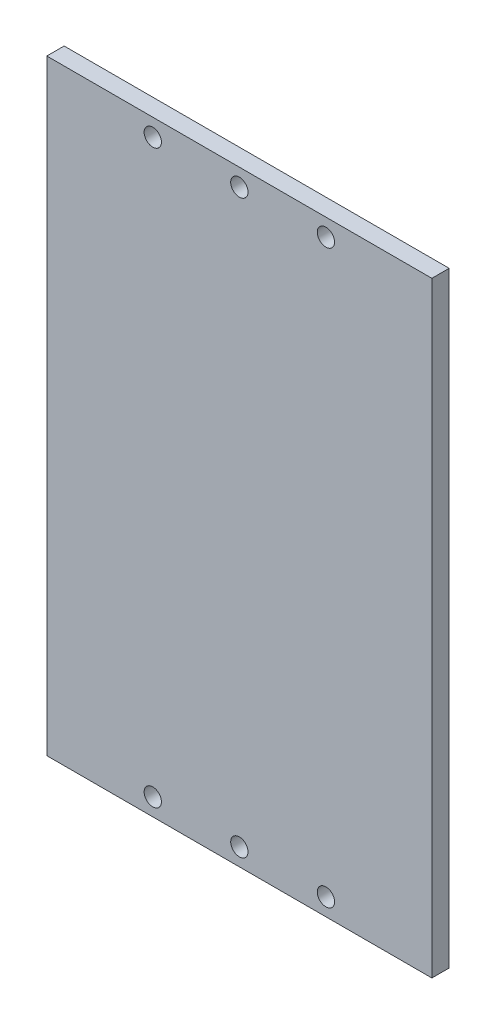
from build123d import *

# Parameters (mm, degrees)
CROQUIS1_W              = 44.48
CROQUIS1_H              = 70
CROQUIS1_R              = 1
SALIENTE_EXTRUIR2_DEPTH = 2


with BuildPart() as part:
    # Croquis1 → Saliente-Extruir2 (new body)
    with BuildSketch(Plane.XY):
        with Locations((-8.27, -30)):
            Rectangle(CROQUIS1_W, CROQUIS1_H)
        with Locations((-8.27, -63)):
            Circle(CROQUIS1_R, mode=Mode.SUBTRACT)
        with Locations((1.73, -63)):
            Circle(CROQUIS1_R, mode=Mode.SUBTRACT)
        with Locations((-18.27, -63)):
            Circle(CROQUIS1_R, mode=Mode.SUBTRACT)
        with Locations(Location((1.73, 3, 0), (0, 0, 180))):
            Circle(CROQUIS1_R, mode=Mode.SUBTRACT)
        with Locations(Location((-8.27, 3, 0), (0, 0, 180))):
            Circle(CROQUIS1_R, mode=Mode.SUBTRACT)
        with Locations(Location((-18.27, 3, 0), (0, 0, 180))):
            Circle(CROQUIS1_R, mode=Mode.SUBTRACT)
    extrude(amount=SALIENTE_EXTRUIR2_DEPTH)


solid = part.part
